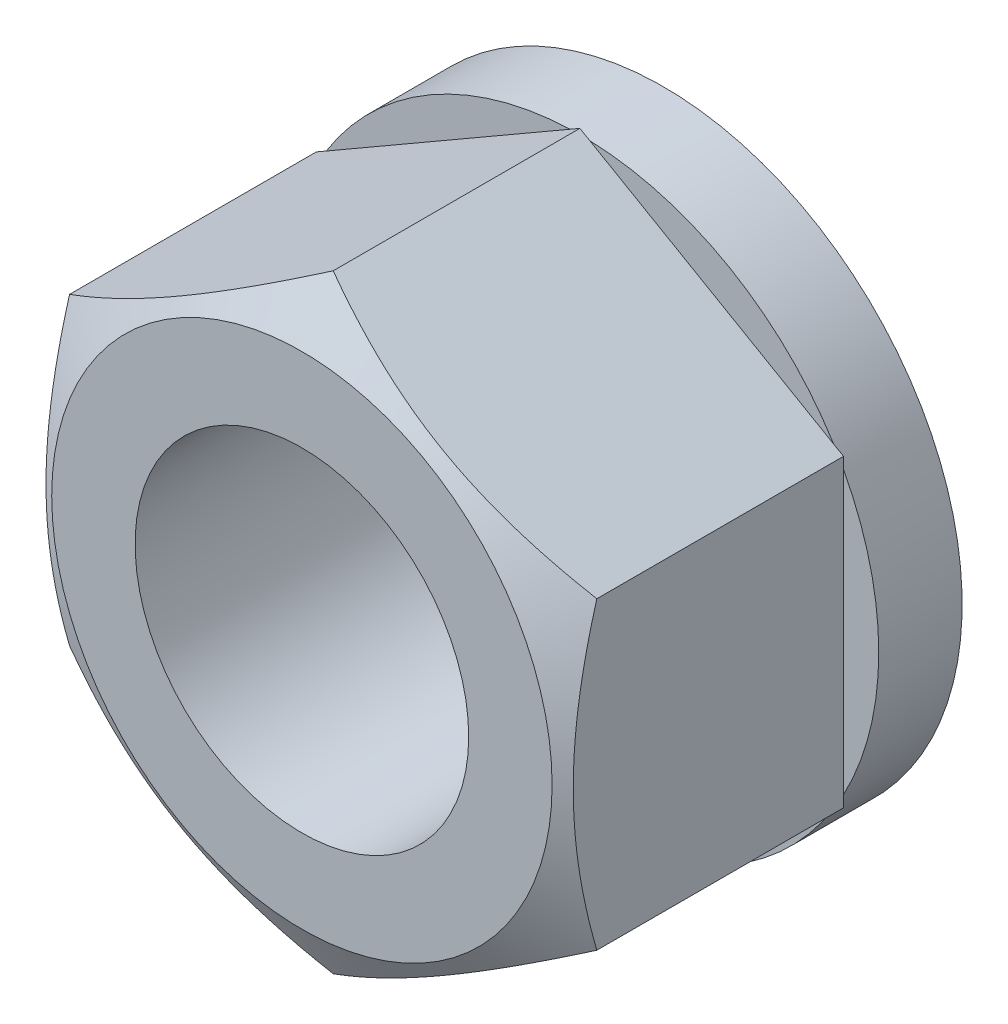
ISO-10303-21;
HEADER;
FILE_DESCRIPTION(('STEP AP214'),'2;1');
FILE_NAME('part.step','',(''),(''),'','','');
FILE_SCHEMA(('AUTOMOTIVE_DESIGN { 1 0 10303 214 1 1 1 1 }'));
ENDSEC;
DATA;
#1=APPLICATION_CONTEXT('core data for automotive mechanical design processes');
#2=APPLICATION_PROTOCOL_DEFINITION('international standard','automotive_design',2000,#1);
#3=PRODUCT_CONTEXT('',#1,'mechanical');
#4=PRODUCT('Part','Part','',(#3));
#5=PRODUCT_RELATED_PRODUCT_CATEGORY('part','',(#4));
#6=PRODUCT_DEFINITION_FORMATION('','',#4);
#7=PRODUCT_DEFINITION_CONTEXT('part definition',#1,'design');
#8=PRODUCT_DEFINITION('design','',#6,#7);
#9=PRODUCT_DEFINITION_SHAPE('','',#8);
#10=(LENGTH_UNIT() NAMED_UNIT(*) SI_UNIT(.MILLI.,.METRE.));
#11=(NAMED_UNIT(*) PLANE_ANGLE_UNIT() SI_UNIT($,.RADIAN.));
#12=(NAMED_UNIT(*) SI_UNIT($,.STERADIAN.) SOLID_ANGLE_UNIT());
#13=UNCERTAINTY_MEASURE_WITH_UNIT(LENGTH_MEASURE(1.E-05),#10,'distance_accuracy_value','');
#14=(GEOMETRIC_REPRESENTATION_CONTEXT(3) GLOBAL_UNCERTAINTY_ASSIGNED_CONTEXT((#13)) GLOBAL_UNIT_ASSIGNED_CONTEXT((#10,
#11,#12)) REPRESENTATION_CONTEXT('',''));
#15=CARTESIAN_POINT('',(0.,0.,0.));
#16=DIRECTION('',(0.,0.,1.));
#17=DIRECTION('',(1.,0.,0.));
#18=AXIS2_PLACEMENT_3D('',#15,#16,#17);
#19=CARTESIAN_POINT('',(0.,0.,3.));
#20=DIRECTION('',(0.,0.,1.));
#21=DIRECTION('',(1.,0.,0.));
#22=AXIS2_PLACEMENT_3D('',#19,#20,#21);
#23=PLANE('',#22);
#24=DIRECTION('',(-0.866025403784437,0.5,0.));
#25=VECTOR('',#24,1.);
#26=CARTESIAN_POINT('',(9.48297817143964,5.47499999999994,3.));
#27=LINE('',#26,#25);
#28=CARTESIAN_POINT('',(9.12631733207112,5.68091823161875,3.));
#29=VERTEX_POINT('',#28);
#30=CARTESIAN_POINT('',(0.356660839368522,10.7440817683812,3.));
#31=VERTEX_POINT('',#30);
#32=EDGE_CURVE('E28',#29,#31,#27,.T.);
#33=ORIENTED_EDGE('',*,*,#32,.F.);
#34=CARTESIAN_POINT('',(0.,0.,3.));
#35=DIRECTION('',(0.,0.,1.));
#36=DIRECTION('',(1.,0.,0.));
#37=AXIS2_PLACEMENT_3D('',#34,#35,#36);
#38=CIRCLE('',#37,10.75);
#39=EDGE_CURVE('E139',#29,#31,#38,.T.);
#40=ORIENTED_EDGE('',*,*,#39,.T.);
#41=EDGE_LOOP('',(#33,#40));
#42=FACE_BOUND('',#41,.T.);
#43=ADVANCED_FACE('F14',(#42),#23,.T.);
#44=DIRECTION('',(0.,1.,0.));
#45=VECTOR('',#44,1.);
#46=CARTESIAN_POINT('',(9.48297817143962,-5.475,3.));
#47=LINE('',#46,#45);
#48=CARTESIAN_POINT('',(9.48297817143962,-5.06316353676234,3.));
#49=VERTEX_POINT('',#48);
#50=CARTESIAN_POINT('',(9.48297817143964,5.0631635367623,3.));
#51=VERTEX_POINT('',#50);
#52=EDGE_CURVE('E41',#49,#51,#47,.T.);
#53=ORIENTED_EDGE('',*,*,#52,.F.);
#54=EDGE_CURVE('E131',#49,#51,#38,.T.);
#55=ORIENTED_EDGE('',*,*,#54,.T.);
#56=EDGE_LOOP('',(#53,#55));
#57=FACE_BOUND('',#56,.T.);
#58=ADVANCED_FACE('F247',(#57),#23,.T.);
#59=DIRECTION('',(0.866025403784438,0.5,0.));
#60=VECTOR('',#59,1.);
#61=CARTESIAN_POINT('',(0.,-10.95,3.));
#62=LINE('',#61,#60);
#63=CARTESIAN_POINT('',(0.356660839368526,-10.7440817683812,3.));
#64=VERTEX_POINT('',#63);
#65=CARTESIAN_POINT('',(9.12631733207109,-5.6809182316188,3.));
#66=VERTEX_POINT('',#65);
#67=EDGE_CURVE('E213',#64,#66,#62,.T.);
#68=ORIENTED_EDGE('',*,*,#67,.F.);
#69=EDGE_CURVE('E154',#64,#66,#38,.T.);
#70=ORIENTED_EDGE('',*,*,#69,.T.);
#71=EDGE_LOOP('',(#68,#70));
#72=FACE_BOUND('',#71,.T.);
#73=ADVANCED_FACE('F254',(#72),#23,.T.);
#74=DIRECTION('',(0.866025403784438,-0.5,0.));
#75=VECTOR('',#74,1.);
#76=CARTESIAN_POINT('',(-9.48297817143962,-5.475,3.));
#77=LINE('',#76,#75);
#78=CARTESIAN_POINT('',(-9.12631733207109,-5.6809182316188,3.));
#79=VERTEX_POINT('',#78);
#80=CARTESIAN_POINT('',(-0.356660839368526,-10.7440817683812,3.));
#81=VERTEX_POINT('',#80);
#82=EDGE_CURVE('E209',#79,#81,#77,.T.);
#83=ORIENTED_EDGE('',*,*,#82,.F.);
#84=EDGE_CURVE('E164',#79,#81,#38,.T.);
#85=ORIENTED_EDGE('',*,*,#84,.T.);
#86=EDGE_LOOP('',(#83,#85));
#87=FACE_BOUND('',#86,.T.);
#88=ADVANCED_FACE('F264',(#87),#23,.T.);
#89=DIRECTION('',(0.,-1.,0.));
#90=VECTOR('',#89,1.);
#91=CARTESIAN_POINT('',(-9.48297817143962,5.475,3.));
#92=LINE('',#91,#90);
#93=CARTESIAN_POINT('',(-9.48297817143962,5.06316353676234,3.));
#94=VERTEX_POINT('',#93);
#95=CARTESIAN_POINT('',(-9.48297817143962,-5.06316353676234,3.));
#96=VERTEX_POINT('',#95);
#97=EDGE_CURVE('E146',#94,#96,#92,.T.);
#98=ORIENTED_EDGE('',*,*,#97,.F.);
#99=EDGE_CURVE('E174',#94,#96,#38,.T.);
#100=ORIENTED_EDGE('',*,*,#99,.T.);
#101=EDGE_LOOP('',(#98,#100));
#102=FACE_BOUND('',#101,.T.);
#103=ADVANCED_FACE('F257',(#102),#23,.T.);
#104=DIRECTION('',(-0.866025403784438,-0.5,0.));
#105=VECTOR('',#104,1.);
#106=CARTESIAN_POINT('',(0.,10.95,3.));
#107=LINE('',#106,#105);
#108=CARTESIAN_POINT('',(-0.356660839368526,10.7440817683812,3.));
#109=VERTEX_POINT('',#108);
#110=CARTESIAN_POINT('',(-9.12631733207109,5.6809182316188,3.));
#111=VERTEX_POINT('',#110);
#112=EDGE_CURVE('E138',#109,#111,#107,.T.);
#113=ORIENTED_EDGE('',*,*,#112,.F.);
#114=EDGE_CURVE('E184',#109,#111,#38,.T.);
#115=ORIENTED_EDGE('',*,*,#114,.T.);
#116=EDGE_LOOP('',(#113,#115));
#117=FACE_BOUND('',#116,.T.);
#118=ADVANCED_FACE('F249',(#117),#23,.T.);
#119=CARTESIAN_POINT('',(0.,0.,3.));
#120=DIRECTION('',(0.,0.,-1.));
#121=DIRECTION('',(-1.,0.,0.));
#122=AXIS2_PLACEMENT_3D('',#119,#120,#121);
#123=CYLINDRICAL_SURFACE('',#122,10.75);
#124=EDGE_CURVE('E136',#51,#29,#38,.T.);
#125=ORIENTED_EDGE('',*,*,#124,.F.);
#126=ORIENTED_EDGE('',*,*,#54,.F.);
#127=EDGE_CURVE('E152',#66,#49,#38,.T.);
#128=ORIENTED_EDGE('',*,*,#127,.F.);
#129=ORIENTED_EDGE('',*,*,#69,.F.);
#130=EDGE_CURVE('E160',#81,#64,#38,.T.);
#131=ORIENTED_EDGE('',*,*,#130,.F.);
#132=ORIENTED_EDGE('',*,*,#84,.F.);
#133=EDGE_CURVE('E170',#96,#79,#38,.T.);
#134=ORIENTED_EDGE('',*,*,#133,.F.);
#135=ORIENTED_EDGE('',*,*,#99,.F.);
#136=EDGE_CURVE('E180',#111,#94,#38,.T.);
#137=ORIENTED_EDGE('',*,*,#136,.F.);
#138=ORIENTED_EDGE('',*,*,#114,.F.);
#139=EDGE_CURVE('E151',#31,#109,#38,.T.);
#140=ORIENTED_EDGE('',*,*,#139,.F.);
#141=ORIENTED_EDGE('',*,*,#39,.F.);
#142=EDGE_LOOP('',(#125,#126,#128,#129,#131,#132,#134,#135,#137,#138,#140,#141));
#143=FACE_BOUND('',#142,.T.);
#144=CARTESIAN_POINT('',(0.,0.,0.));
#145=DIRECTION('',(0.,0.,-1.));
#146=DIRECTION('',(-1.,0.,0.));
#147=AXIS2_PLACEMENT_3D('',#144,#145,#146);
#148=CIRCLE('',#147,10.75);
#149=CARTESIAN_POINT('',(-10.75,0.,0.));
#150=VERTEX_POINT('',#149);
#151=EDGE_CURVE('E345',#150,#150,#148,.T.);
#152=ORIENTED_EDGE('',*,*,#151,.F.);
#153=EDGE_LOOP('',(#152));
#154=FACE_BOUND('',#153,.T.);
#155=ADVANCED_FACE('F16',(#143,#154),#123,.T.);
#156=CARTESIAN_POINT('',(0.,0.,3.));
#157=DIRECTION('',(0.,0.,-1.));
#158=DIRECTION('',(-1.,0.,0.));
#159=AXIS2_PLACEMENT_3D('',#156,#157,#158);
#160=CYLINDRICAL_SURFACE('',#159,6.1);
#161=CARTESIAN_POINT('',(0.,0.,3.));
#162=DIRECTION('',(0.,0.,1.));
#163=DIRECTION('',(1.,0.,0.));
#164=AXIS2_PLACEMENT_3D('',#161,#162,#163);
#165=CIRCLE('',#164,6.1);
#166=CARTESIAN_POINT('',(6.1,0.,3.));
#167=VERTEX_POINT('',#166);
#168=EDGE_CURVE('E128',#167,#167,#165,.T.);
#169=ORIENTED_EDGE('',*,*,#168,.T.);
#170=EDGE_LOOP('',(#169));
#171=FACE_BOUND('',#170,.T.);
#172=CARTESIAN_POINT('',(0.,0.,0.));
#173=DIRECTION('',(0.,0.,-1.));
#174=DIRECTION('',(-1.,0.,0.));
#175=AXIS2_PLACEMENT_3D('',#172,#173,#174);
#176=CIRCLE('',#175,6.1);
#177=CARTESIAN_POINT('',(-6.1,0.,0.));
#178=VERTEX_POINT('',#177);
#179=EDGE_CURVE('E343',#178,#178,#176,.T.);
#180=ORIENTED_EDGE('',*,*,#179,.T.);
#181=EDGE_LOOP('',(#180));
#182=FACE_BOUND('',#181,.T.);
#183=ADVANCED_FACE('F263',(#171,#182),#160,.F.);
#184=CARTESIAN_POINT('',(0.,10.95,13.));
#185=DIRECTION('',(0.,0.,1.));
#186=DIRECTION('',(1.,0.,0.));
#187=AXIS2_PLACEMENT_3D('',#184,#185,#186);
#188=PLANE('',#187);
#189=CARTESIAN_POINT('',(0.,0.,13.));
#190=DIRECTION('',(0.,0.,-1.));
#191=DIRECTION('',(-1.,0.,0.));
#192=AXIS2_PLACEMENT_3D('',#189,#190,#191);
#193=CIRCLE('',#192,9.);
#194=CARTESIAN_POINT('',(-9.,0.,13.));
#195=VERTEX_POINT('',#194);
#196=EDGE_CURVE('E121',#195,#195,#193,.T.);
#197=ORIENTED_EDGE('',*,*,#196,.F.);
#198=EDGE_LOOP('',(#197));
#199=FACE_BOUND('',#198,.T.);
#200=CARTESIAN_POINT('',(0.,0.,13.));
#201=DIRECTION('',(0.,0.,1.));
#202=DIRECTION('',(1.,0.,0.));
#203=AXIS2_PLACEMENT_3D('',#200,#201,#202);
#204=CIRCLE('',#203,6.);
#205=CARTESIAN_POINT('',(6.,0.,13.));
#206=VERTEX_POINT('',#205);
#207=EDGE_CURVE('E347',#206,#206,#204,.T.);
#208=ORIENTED_EDGE('',*,*,#207,.F.);
#209=EDGE_LOOP('',(#208));
#210=FACE_BOUND('',#209,.T.);
#211=ADVANCED_FACE('F332',(#199,#210),#188,.T.);
#212=CARTESIAN_POINT('',(9.48297817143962,-5.475,13.));
#213=DIRECTION('',(-1.,0.,0.));
#214=DIRECTION('',(0.,-1.,0.));
#215=AXIS2_PLACEMENT_3D('',#212,#213,#214);
#216=PLANE('',#215);
#217=DIRECTION('',(0.,0.,-1.));
#218=VECTOR('',#217,1.);
#219=CARTESIAN_POINT('',(9.48297817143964,5.47499999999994,13.));
#220=LINE('',#219,#218);
#221=CARTESIAN_POINT('',(9.48297817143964,5.47499999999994,11.8741669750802));
#222=VERTEX_POINT('',#221);
#223=CARTESIAN_POINT('',(9.48297817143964,5.47499999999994,3.));
#224=VERTEX_POINT('',#223);
#225=EDGE_CURVE('E216',#222,#224,#220,.T.);
#226=ORIENTED_EDGE('',*,*,#225,.F.);
#227=CARTESIAN_POINT('',(9.4829781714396,-14.5596755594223,8.1643525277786));
#228=CARTESIAN_POINT('',(9.4829781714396,-14.3531914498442,8.26424422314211));
#229=CARTESIAN_POINT('',(9.4829781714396,-14.1464610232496,8.36362652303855));
#230=CARTESIAN_POINT('',(9.4829781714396,-13.7324560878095,8.5612566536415));
#231=CARTESIAN_POINT('',(9.4829781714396,-13.5251815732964,8.6595044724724));
#232=CARTESIAN_POINT('',(9.4829781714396,-12.9024074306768,8.95239956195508));
#233=CARTESIAN_POINT('',(9.4829781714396,-12.4860206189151,9.1451677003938));
#234=CARTESIAN_POINT('',(9.4829781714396,-11.6480734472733,9.52556842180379));
#235=CARTESIAN_POINT('',(9.48297817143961,-11.2264971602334,9.71316600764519));
#236=CARTESIAN_POINT('',(9.48297817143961,-10.3799402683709,10.0804879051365));
#237=CARTESIAN_POINT('',(9.48297817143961,-9.95495983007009,10.2602125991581));
#238=CARTESIAN_POINT('',(9.48297817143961,-9.08779519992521,10.6150700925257));
#239=CARTESIAN_POINT('',(9.48297817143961,-8.645483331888,10.7898926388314));
#240=CARTESIAN_POINT('',(9.48297817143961,-7.75563205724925,11.1259475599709));
#241=CARTESIAN_POINT('',(9.48297817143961,-7.30809206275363,11.2871783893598));
#242=CARTESIAN_POINT('',(9.48297817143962,-6.40795328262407,11.5917084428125));
#243=CARTESIAN_POINT('',(9.48297817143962,-5.95536736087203,11.7350452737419));
#244=CARTESIAN_POINT('',(9.48297817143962,-5.04372276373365,11.9990937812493));
#245=CARTESIAN_POINT('',(9.48297817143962,-4.58466622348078,12.1198127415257));
#246=CARTESIAN_POINT('',(9.48297817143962,-3.66225298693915,12.3320961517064));
#247=CARTESIAN_POINT('',(9.48297817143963,-3.19893224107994,12.4238125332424));
#248=CARTESIAN_POINT('',(9.48297817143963,-2.49985211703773,12.5355904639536));
#249=CARTESIAN_POINT('',(9.48297817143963,-2.26612393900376,12.5685518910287));
#250=CARTESIAN_POINT('',(9.48297817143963,-1.79755647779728,12.625226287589));
#251=CARTESIAN_POINT('',(9.48297817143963,-1.56271730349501,12.648940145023));
#252=CARTESIAN_POINT('',(9.48297817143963,-1.09524528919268,12.686357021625));
#253=CARTESIAN_POINT('',(9.48297817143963,-0.862622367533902,12.7001835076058));
#254=CARTESIAN_POINT('',(9.48297817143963,-0.397000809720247,12.7179979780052));
#255=CARTESIAN_POINT('',(9.48297817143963,-0.164002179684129,12.7219861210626));
#256=CARTESIAN_POINT('',(9.48297817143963,0.301956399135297,12.7200290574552));
#257=CARTESIAN_POINT('',(9.48297817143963,0.534916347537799,12.7140837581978));
#258=CARTESIAN_POINT('',(9.48297817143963,1.00038339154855,12.6924022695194));
#259=CARTESIAN_POINT('',(9.48297817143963,1.23289046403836,12.6766655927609));
#260=CARTESIAN_POINT('',(9.48297817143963,1.79619581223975,12.6270064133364));
#261=CARTESIAN_POINT('',(9.48297817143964,2.12656969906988,12.588187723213));
#262=CARTESIAN_POINT('',(9.48297817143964,2.78476965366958,12.4929315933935));
#263=CARTESIAN_POINT('',(9.48297817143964,3.11259534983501,12.4364916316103));
#264=CARTESIAN_POINT('',(9.48297817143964,3.76541934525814,12.3080010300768));
#265=CARTESIAN_POINT('',(9.48297817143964,4.09041514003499,12.235937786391));
#266=CARTESIAN_POINT('',(9.48297817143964,4.73710047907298,12.0783907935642));
#267=CARTESIAN_POINT('',(9.48297817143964,5.05879008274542,11.9929072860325));
#268=CARTESIAN_POINT('',(9.48297817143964,5.7058598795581,11.808592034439));
#269=CARTESIAN_POINT('',(9.48297817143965,6.03116849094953,11.7095107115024));
#270=CARTESIAN_POINT('',(9.48297817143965,6.67857986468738,11.5014284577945));
#271=CARTESIAN_POINT('',(9.48297817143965,7.00068260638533,11.3924274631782));
#272=CARTESIAN_POINT('',(9.48297817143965,7.64184704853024,11.1662086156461));
#273=CARTESIAN_POINT('',(9.48297817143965,7.96090979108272,11.048993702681));
#274=CARTESIAN_POINT('',(9.48297817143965,8.59641278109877,10.8076947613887));
#275=CARTESIAN_POINT('',(9.48297817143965,8.9128530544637,10.6836108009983));
#276=CARTESIAN_POINT('',(9.48297817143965,9.63911108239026,10.3911863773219));
#277=CARTESIAN_POINT('',(9.48297817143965,10.0481212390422,10.220843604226));
#278=CARTESIAN_POINT('',(9.48297817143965,10.8628429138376,9.87242321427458));
#279=CARTESIAN_POINT('',(9.48297817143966,11.2685542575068,9.69434519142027));
#280=CARTESIAN_POINT('',(9.48297817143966,12.0772674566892,9.33194983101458));
#281=CARTESIAN_POINT('',(9.48297817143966,12.4802687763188,9.14763130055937));
#282=CARTESIAN_POINT('',(9.48297817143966,13.2839200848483,8.77396765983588));
#283=CARTESIAN_POINT('',(9.48297817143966,13.6845701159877,8.58462264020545));
#284=CARTESIAN_POINT('',(9.48297817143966,14.4842867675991,8.20162873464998));
#285=CARTESIAN_POINT('',(9.48297817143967,14.8833514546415,8.00797581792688));
#286=CARTESIAN_POINT('',(9.48297817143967,15.6798068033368,7.61725458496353));
#287=CARTESIAN_POINT('',(9.48297817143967,16.0771974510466,7.42018624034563));
#288=CARTESIAN_POINT('',(9.48297817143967,17.2671534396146,6.82478343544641));
#289=CARTESIAN_POINT('',(9.48297817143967,18.0575958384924,6.42220631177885));
#290=CARTESIAN_POINT('',(9.48297817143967,19.5716727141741,5.64131960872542));
#291=CARTESIAN_POINT('',(9.48297817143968,20.2956249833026,5.26362355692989));
#292=CARTESIAN_POINT('',(9.48297817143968,21.7408334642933,4.50305867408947));
#293=CARTESIAN_POINT('',(9.48297817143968,22.4620895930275,4.1201896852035));
#294=CARTESIAN_POINT('',(9.48297817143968,23.9008559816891,3.35136008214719));
#295=CARTESIAN_POINT('',(9.48297817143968,24.6183710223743,2.96540840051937));
#296=CARTESIAN_POINT('',(9.48297817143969,26.0516650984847,2.19037903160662));
#297=CARTESIAN_POINT('',(9.48297817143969,26.7674442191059,1.8013015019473));
#298=CARTESIAN_POINT('',(9.48297817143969,27.4825783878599,1.41105000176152));
#299=B_SPLINE_CURVE_WITH_KNOTS('',3,(#227,#228,#229,#230,#231,#232,#233,#234,#235,#236,#237,
#238,#239,#240,#241,#242,#243,#244,#245,#246,#247,#248,#249,#250,#251,#252,#253,#254,#255,#256,
#257,#258,#259,#260,#261,#262,#263,#264,#265,#266,#267,#268,#269,#270,#271,#272,#273,#274,#275,
#276,#277,#278,#279,#280,#281,#282,#283,#284,#285,#286,#287,#288,#289,#290,#291,#292,#293,#294,
#295,#296,#297,#298),.UNSPECIFIED.,.F.,.F.,(4,2,2,2,2,2,2,2,2,2,2,2,2,2,2,2,2,2,2,2,2,2,2,2,2,2,
2,2,2,2,2,2,2,2,2,4),(0.,0.688131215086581,1.37626962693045,2.7527578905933,4.13699084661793,
5.52115649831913,6.9478065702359,8.37461864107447,9.79837968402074,11.221681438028,
12.6373986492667,13.345367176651,14.0532677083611,14.7521663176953,15.4510536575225,
16.1499475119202,16.8488761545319,17.8462609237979,18.843788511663,19.8421238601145,
20.8404412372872,21.8604402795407,22.8804458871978,23.9000882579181,24.9197205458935,
26.2488074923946,27.5779642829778,28.9073765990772,30.2367649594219,31.567454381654,
32.898154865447,35.5592460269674,38.0088869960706,40.4586028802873,42.9027875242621,
45.3468496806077),.UNSPECIFIED.);
#300=CARTESIAN_POINT('',(9.48297817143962,-5.475,11.8741669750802));
#301=VERTEX_POINT('',#300);
#302=EDGE_CURVE('E35',#222,#301,#299,.F.);
#303=ORIENTED_EDGE('',*,*,#302,.T.);
#304=DIRECTION('',(0.,0.,-1.));
#305=VECTOR('',#304,1.);
#306=CARTESIAN_POINT('',(9.48297817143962,-5.475,13.));
#307=LINE('',#306,#305);
#308=CARTESIAN_POINT('',(9.48297817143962,-5.475,3.));
#309=VERTEX_POINT('',#308);
#310=EDGE_CURVE('E218',#301,#309,#307,.T.);
#311=ORIENTED_EDGE('',*,*,#310,.T.);
#312=EDGE_CURVE('E214',#309,#49,#47,.T.);
#313=ORIENTED_EDGE('',*,*,#312,.T.);
#314=ORIENTED_EDGE('',*,*,#52,.T.);
#315=EDGE_CURVE('E212',#51,#224,#47,.T.);
#316=ORIENTED_EDGE('',*,*,#315,.T.);
#317=EDGE_LOOP('',(#226,#303,#311,#313,#314,#316));
#318=FACE_BOUND('',#317,.T.);
#319=ADVANCED_FACE('F313',(#318),#216,.F.);
#320=CARTESIAN_POINT('',(0.,-10.95,13.));
#321=DIRECTION('',(-0.5,0.866025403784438,0.));
#322=DIRECTION('',(-0.866025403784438,-0.5,0.));
#323=AXIS2_PLACEMENT_3D('',#320,#321,#322);
#324=PLANE('',#323);
#325=ORIENTED_EDGE('',*,*,#310,.F.);
#326=CARTESIAN_POINT('',(9.48317817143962,-5.47488452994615,11.8741003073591));
#327=CARTESIAN_POINT('',(9.27472157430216,-5.59523700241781,11.9435746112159));
#328=CARTESIAN_POINT('',(9.06548774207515,-5.71603821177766,12.0098957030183));
#329=CARTESIAN_POINT('',(8.64534217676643,-5.95860936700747,12.1353565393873));
#330=CARTESIAN_POINT('',(8.43442991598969,-6.08037961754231,12.1944939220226));
#331=CARTESIAN_POINT('',(7.79829469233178,-6.44765246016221,12.3599860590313));
#332=CARTESIAN_POINT('',(7.37056049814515,-6.69460491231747,12.4541172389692));
#333=CARTESIAN_POINT('',(6.73047585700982,-7.0641579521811,12.5644948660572));
#334=CARTESIAN_POINT('',(6.5200377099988,-7.18565447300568,12.5959373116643));
#335=CARTESIAN_POINT('',(6.09818709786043,-7.42921003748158,12.6486643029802));
#336=CARTESIAN_POINT('',(5.88677461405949,-7.55126909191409,12.6699486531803));
#337=CARTESIAN_POINT('',(5.46359699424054,-7.79559080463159,12.7018140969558));
#338=CARTESIAN_POINT('',(5.25183257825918,-7.91785304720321,12.7124079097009));
#339=CARTESIAN_POINT('',(4.82810813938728,-8.16249046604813,12.7226671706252));
#340=CARTESIAN_POINT('',(4.61614812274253,-8.28486563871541,12.7223329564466));
#341=CARTESIAN_POINT('',(4.21988362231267,-8.51364905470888,12.7114963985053));
#342=CARTESIAN_POINT('',(4.03555117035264,-8.62007344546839,12.7023159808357));
#343=CARTESIAN_POINT('',(3.66731738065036,-8.83267332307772,12.6758683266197));
#344=CARTESIAN_POINT('',(3.48341607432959,-8.93884879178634,12.6586005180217));
#345=CARTESIAN_POINT('',(2.93242473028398,-9.25696379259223,12.5950742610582));
#346=CARTESIAN_POINT('',(2.56630998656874,-9.46834023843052,12.5371008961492));
#347=CARTESIAN_POINT('',(1.83019690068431,-9.8933353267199,12.3921669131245));
#348=CARTESIAN_POINT('',(1.46029250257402,-10.1068997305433,12.3045919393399));
#349=CARTESIAN_POINT('',(0.725999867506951,-10.5308437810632,12.1058331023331));
#350=CARTESIAN_POINT('',(0.361602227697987,-10.741228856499,11.9946959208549));
#351=CARTESIAN_POINT('',(-0.000199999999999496,-10.9501154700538,11.8741003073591));
#352=B_SPLINE_CURVE_WITH_KNOTS('',3,(#326,#327,#328,#329,#330,#331,#332,#333,#334,#335,#336,
#337,#338,#339,#340,#341,#342,#343,#344,#345,#346,#347,#348,#349,#350,#351),.UNSPECIFIED.,.F.,
.F.,(4,2,2,2,2,2,2,2,2,2,2,2,4),(0.,0.751531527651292,1.50330948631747,3.01006572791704,
3.74495129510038,4.47985100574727,5.21387532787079,5.94787697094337,6.58685772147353,
7.22588367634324,8.50484368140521,9.81216804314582,11.116926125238),.UNSPECIFIED.);
#353=CARTESIAN_POINT('',(0.,-10.95,11.8741669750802));
#354=VERTEX_POINT('',#353);
#355=EDGE_CURVE('E267',#301,#354,#352,.T.);
#356=ORIENTED_EDGE('',*,*,#355,.T.);
#357=DIRECTION('',(0.,0.,-1.));
#358=VECTOR('',#357,1.);
#359=CARTESIAN_POINT('',(0.,-10.95,13.));
#360=LINE('',#359,#358);
#361=CARTESIAN_POINT('',(0.,-10.95,3.));
#362=VERTEX_POINT('',#361);
#363=EDGE_CURVE('E220',#354,#362,#360,.T.);
#364=ORIENTED_EDGE('',*,*,#363,.T.);
#365=EDGE_CURVE('E210',#362,#64,#62,.T.);
#366=ORIENTED_EDGE('',*,*,#365,.T.);
#367=ORIENTED_EDGE('',*,*,#67,.T.);
#368=EDGE_CURVE('E208',#66,#309,#62,.T.);
#369=ORIENTED_EDGE('',*,*,#368,.T.);
#370=EDGE_LOOP('',(#325,#356,#364,#366,#367,#369));
#371=FACE_BOUND('',#370,.T.);
#372=ADVANCED_FACE('F310',(#371),#324,.F.);
#373=CARTESIAN_POINT('',(-9.48297817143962,-5.475,13.));
#374=DIRECTION('',(0.5,0.866025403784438,0.));
#375=DIRECTION('',(-0.866025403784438,0.5,0.));
#376=AXIS2_PLACEMENT_3D('',#373,#374,#375);
#377=PLANE('',#376);
#378=ORIENTED_EDGE('',*,*,#363,.F.);
#379=CARTESIAN_POINT('',(0.0002,-10.9501154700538,11.8741003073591));
#380=CARTESIAN_POINT('',(-0.208256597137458,-10.8297629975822,11.9435746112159));
#381=CARTESIAN_POINT('',(-0.417490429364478,-10.7089617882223,12.0098957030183));
#382=CARTESIAN_POINT('',(-0.837635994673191,-10.4663906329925,12.1353565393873));
#383=CARTESIAN_POINT('',(-1.04854825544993,-10.3446203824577,12.1944939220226));
#384=CARTESIAN_POINT('',(-1.68468347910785,-9.97734753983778,12.3599860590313));
#385=CARTESIAN_POINT('',(-2.11241767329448,-9.73039508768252,12.4541172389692));
#386=CARTESIAN_POINT('',(-2.75250231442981,-9.36084204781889,12.5644948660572));
#387=CARTESIAN_POINT('',(-2.96294046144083,-9.23934552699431,12.5959373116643));
#388=CARTESIAN_POINT('',(-3.3847910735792,-8.99578996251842,12.6486643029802));
#389=CARTESIAN_POINT('',(-3.59620355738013,-8.8737309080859,12.6699486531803));
#390=CARTESIAN_POINT('',(-4.01938117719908,-8.6294091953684,12.7018140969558));
#391=CARTESIAN_POINT('',(-4.23114559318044,-8.50714695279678,12.7124079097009));
#392=CARTESIAN_POINT('',(-4.65487003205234,-8.26250953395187,12.7226671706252));
#393=CARTESIAN_POINT('',(-4.86683004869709,-8.14013436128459,12.7223329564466));
#394=CARTESIAN_POINT('',(-5.26309454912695,-7.91135094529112,12.7114963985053));
#395=CARTESIAN_POINT('',(-5.44742700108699,-7.8049265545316,12.7023159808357));
#396=CARTESIAN_POINT('',(-5.81566079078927,-7.59232667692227,12.6758683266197));
#397=CARTESIAN_POINT('',(-5.99956209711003,-7.48615120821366,12.6586005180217));
#398=CARTESIAN_POINT('',(-6.55055344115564,-7.16803620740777,12.5950742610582));
#399=CARTESIAN_POINT('',(-6.91666818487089,-6.95665976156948,12.5371008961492));
#400=CARTESIAN_POINT('',(-7.65278127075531,-6.5316646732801,12.3921669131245));
#401=CARTESIAN_POINT('',(-8.0226856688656,-6.3181002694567,12.3045919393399));
#402=CARTESIAN_POINT('',(-8.75697830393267,-5.89415621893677,12.1058331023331));
#403=CARTESIAN_POINT('',(-9.12137594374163,-5.683771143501,11.9946959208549));
#404=CARTESIAN_POINT('',(-9.48317817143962,-5.47488452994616,11.8741003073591));
#405=B_SPLINE_CURVE_WITH_KNOTS('',3,(#379,#380,#381,#382,#383,#384,#385,#386,#387,#388,#389,
#390,#391,#392,#393,#394,#395,#396,#397,#398,#399,#400,#401,#402,#403,#404),.UNSPECIFIED.,.F.,
.F.,(4,2,2,2,2,2,2,2,2,2,2,2,4),(0.,0.751531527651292,1.50330948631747,3.01006572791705,
3.74495129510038,4.47985100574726,5.21387532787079,5.94787697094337,6.58685772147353,
7.22588367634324,8.50484368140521,9.81216804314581,11.116926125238),.UNSPECIFIED.);
#406=CARTESIAN_POINT('',(-9.48297817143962,-5.475,11.8741669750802));
#407=VERTEX_POINT('',#406);
#408=EDGE_CURVE('E227',#354,#407,#405,.T.);
#409=ORIENTED_EDGE('',*,*,#408,.T.);
#410=DIRECTION('',(0.,0.,-1.));
#411=VECTOR('',#410,1.);
#412=CARTESIAN_POINT('',(-9.48297817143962,-5.475,13.));
#413=LINE('',#412,#411);
#414=CARTESIAN_POINT('',(-9.48297817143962,-5.475,3.));
#415=VERTEX_POINT('',#414);
#416=EDGE_CURVE('E133',#407,#415,#413,.T.);
#417=ORIENTED_EDGE('',*,*,#416,.T.);
#418=EDGE_CURVE('E206',#415,#79,#77,.T.);
#419=ORIENTED_EDGE('',*,*,#418,.T.);
#420=ORIENTED_EDGE('',*,*,#82,.T.);
#421=EDGE_CURVE('E205',#81,#362,#77,.T.);
#422=ORIENTED_EDGE('',*,*,#421,.T.);
#423=EDGE_LOOP('',(#378,#409,#417,#419,#420,#422));
#424=FACE_BOUND('',#423,.T.);
#425=ADVANCED_FACE('F225',(#424),#377,.F.);
#426=CARTESIAN_POINT('',(-9.48297817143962,5.475,13.));
#427=DIRECTION('',(1.,0.,0.));
#428=DIRECTION('',(0.,0.,-1.));
#429=AXIS2_PLACEMENT_3D('',#426,#427,#428);
#430=PLANE('',#429);
#431=ORIENTED_EDGE('',*,*,#416,.F.);
#432=CARTESIAN_POINT('',(-9.48297817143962,-14.5596755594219,8.16435252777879));
#433=CARTESIAN_POINT('',(-9.48297817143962,-14.3531914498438,8.26424422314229));
#434=CARTESIAN_POINT('',(-9.48297817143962,-14.1464610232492,8.36362652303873));
#435=CARTESIAN_POINT('',(-9.48297817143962,-13.7324560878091,8.56125665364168));
#436=CARTESIAN_POINT('',(-9.48297817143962,-13.525181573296,8.65950447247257));
#437=CARTESIAN_POINT('',(-9.48297817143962,-12.9024074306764,8.95239956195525));
#438=CARTESIAN_POINT('',(-9.48297817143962,-12.4860206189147,9.14516770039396));
#439=CARTESIAN_POINT('',(-9.48297817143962,-11.6480734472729,9.52556842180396));
#440=CARTESIAN_POINT('',(-9.48297817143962,-11.226497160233,9.71316600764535));
#441=CARTESIAN_POINT('',(-9.48297817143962,-10.3799402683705,10.0804879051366));
#442=CARTESIAN_POINT('',(-9.48297817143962,-9.95495983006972,10.2602125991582));
#443=CARTESIAN_POINT('',(-9.48297817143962,-9.08779519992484,10.6150700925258));
#444=CARTESIAN_POINT('',(-9.48297817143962,-8.64548333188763,10.7898926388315));
#445=CARTESIAN_POINT('',(-9.48297817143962,-7.75563205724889,11.125947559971));
#446=CARTESIAN_POINT('',(-9.48297817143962,-7.30809206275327,11.2871783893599));
#447=CARTESIAN_POINT('',(-9.48297817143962,-6.40795328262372,11.5917084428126));
#448=CARTESIAN_POINT('',(-9.48297817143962,-5.95536736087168,11.735045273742));
#449=CARTESIAN_POINT('',(-9.48297817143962,-5.0437227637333,11.9990937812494));
#450=CARTESIAN_POINT('',(-9.48297817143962,-4.58466622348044,12.1198127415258));
#451=CARTESIAN_POINT('',(-9.48297817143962,-3.66225298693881,12.3320961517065));
#452=CARTESIAN_POINT('',(-9.48297817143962,-3.1989322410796,12.4238125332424));
#453=CARTESIAN_POINT('',(-9.48297817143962,-2.4998521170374,12.5355904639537));
#454=CARTESIAN_POINT('',(-9.48297817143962,-2.26612393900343,12.5685518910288));
#455=CARTESIAN_POINT('',(-9.48297817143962,-1.79755647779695,12.625226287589));
#456=CARTESIAN_POINT('',(-9.48297817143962,-1.56271730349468,12.6489401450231));
#457=CARTESIAN_POINT('',(-9.48297817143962,-1.09524528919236,12.6863570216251));
#458=CARTESIAN_POINT('',(-9.48297817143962,-0.862622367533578,12.7001835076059));
#459=CARTESIAN_POINT('',(-9.48297817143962,-0.397000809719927,12.7179979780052));
#460=CARTESIAN_POINT('',(-9.48297817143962,-0.16400217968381,12.7219861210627));
#461=CARTESIAN_POINT('',(-9.48297817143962,0.301956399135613,12.7200290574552));
#462=CARTESIAN_POINT('',(-9.48297817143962,0.534916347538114,12.7140837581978));
#463=CARTESIAN_POINT('',(-9.48297817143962,1.00038339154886,12.6924022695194));
#464=CARTESIAN_POINT('',(-9.48297817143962,1.23289046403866,12.6766655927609));
#465=CARTESIAN_POINT('',(-9.48297817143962,1.79619581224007,12.6270064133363));
#466=CARTESIAN_POINT('',(-9.48297817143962,2.12656969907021,12.588187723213));
#467=CARTESIAN_POINT('',(-9.48297817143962,2.78476965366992,12.4929315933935));
#468=CARTESIAN_POINT('',(-9.48297817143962,3.11259534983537,12.4364916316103));
#469=CARTESIAN_POINT('',(-9.48297817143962,3.76541934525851,12.3080010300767));
#470=CARTESIAN_POINT('',(-9.48297817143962,4.09041514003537,12.2359377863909));
#471=CARTESIAN_POINT('',(-9.48297817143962,4.73710047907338,12.0783907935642));
#472=CARTESIAN_POINT('',(-9.48297817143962,5.05879008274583,11.9929072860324));
#473=CARTESIAN_POINT('',(-9.48297817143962,5.70585987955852,11.8085920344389));
#474=CARTESIAN_POINT('',(-9.48297817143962,6.03116849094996,11.7095107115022));
#475=CARTESIAN_POINT('',(-9.48297817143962,6.67857986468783,11.5014284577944));
#476=CARTESIAN_POINT('',(-9.48297817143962,7.00068260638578,11.392427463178));
#477=CARTESIAN_POINT('',(-9.48297817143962,7.64184704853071,11.166208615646));
#478=CARTESIAN_POINT('',(-9.48297817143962,7.9609097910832,11.0489937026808));
#479=CARTESIAN_POINT('',(-9.48297817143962,8.59641278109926,10.8076947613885));
#480=CARTESIAN_POINT('',(-9.48297817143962,8.91285305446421,10.6836108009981));
#481=CARTESIAN_POINT('',(-9.48297817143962,9.63911108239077,10.3911863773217));
#482=CARTESIAN_POINT('',(-9.48297817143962,10.0481212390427,10.2208436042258));
#483=CARTESIAN_POINT('',(-9.48297817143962,10.8628429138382,9.87242321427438));
#484=CARTESIAN_POINT('',(-9.48297817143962,11.2685542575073,9.69434519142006));
#485=CARTESIAN_POINT('',(-9.48297817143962,12.0772674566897,9.33194983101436));
#486=CARTESIAN_POINT('',(-9.48297817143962,12.4802687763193,9.14763130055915));
#487=CARTESIAN_POINT('',(-9.48297817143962,13.2839200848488,8.77396765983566));
#488=CARTESIAN_POINT('',(-9.48297817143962,13.6845701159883,8.58462264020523));
#489=CARTESIAN_POINT('',(-9.48297817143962,14.4842867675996,8.20162873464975));
#490=CARTESIAN_POINT('',(-9.48297817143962,14.883351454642,8.00797581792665));
#491=CARTESIAN_POINT('',(-9.48297817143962,15.6798068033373,7.6172545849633));
#492=CARTESIAN_POINT('',(-9.48297817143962,16.0771974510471,7.42018624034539));
#493=CARTESIAN_POINT('',(-9.48297817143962,17.2671534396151,6.82478343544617));
#494=CARTESIAN_POINT('',(-9.48297817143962,18.057595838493,6.4222063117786));
#495=CARTESIAN_POINT('',(-9.48297817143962,19.5716727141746,5.64131960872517));
#496=CARTESIAN_POINT('',(-9.48297817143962,20.2956249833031,5.26362355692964));
#497=CARTESIAN_POINT('',(-9.48297817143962,21.7408334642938,4.50305867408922));
#498=CARTESIAN_POINT('',(-9.48297817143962,22.462089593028,4.12018968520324));
#499=CARTESIAN_POINT('',(-9.48297817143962,23.9008559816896,3.35136008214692));
#500=CARTESIAN_POINT('',(-9.48297817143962,24.6183710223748,2.9654084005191));
#501=CARTESIAN_POINT('',(-9.48297817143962,26.0516650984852,2.19037903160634));
#502=CARTESIAN_POINT('',(-9.48297817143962,26.7674442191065,1.80130150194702));
#503=CARTESIAN_POINT('',(-9.48297817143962,27.4825783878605,1.41105000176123));
#504=B_SPLINE_CURVE_WITH_KNOTS('',3,(#432,#433,#434,#435,#436,#437,#438,#439,#440,#441,#442,
#443,#444,#445,#446,#447,#448,#449,#450,#451,#452,#453,#454,#455,#456,#457,#458,#459,#460,#461,
#462,#463,#464,#465,#466,#467,#468,#469,#470,#471,#472,#473,#474,#475,#476,#477,#478,#479,#480,
#481,#482,#483,#484,#485,#486,#487,#488,#489,#490,#491,#492,#493,#494,#495,#496,#497,#498,#499,
#500,#501,#502,#503),.UNSPECIFIED.,.F.,.F.,(4,2,2,2,2,2,2,2,2,2,2,2,2,2,2,2,2,2,2,2,2,2,2,2,2,2,
2,2,2,2,2,2,2,2,2,4),(0.,0.688131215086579,1.37626962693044,2.75275789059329,4.13699084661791,
5.5211564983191,6.94780657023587,8.37461864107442,9.79837968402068,11.2216814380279,
12.6373986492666,13.3453671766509,14.053267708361,14.7521663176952,15.4510536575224,
16.1499475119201,16.8488761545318,17.8462609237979,18.8437885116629,19.8421238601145,
20.8404412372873,21.8604402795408,22.8804458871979,23.9000882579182,24.9197205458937,
26.2488074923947,27.577964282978,28.9073765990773,30.236764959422,31.5674543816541,
32.8981548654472,35.5592460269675,38.0088869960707,40.4586028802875,42.9027875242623,
45.3468496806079),.UNSPECIFIED.);
#505=CARTESIAN_POINT('',(-9.48297817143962,5.475,11.8741669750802));
#506=VERTEX_POINT('',#505);
#507=EDGE_CURVE('E120',#407,#506,#504,.T.);
#508=ORIENTED_EDGE('',*,*,#507,.T.);
#509=DIRECTION('',(0.,0.,-1.));
#510=VECTOR('',#509,1.);
#511=CARTESIAN_POINT('',(-9.48297817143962,5.475,13.));
#512=LINE('',#511,#510);
#513=CARTESIAN_POINT('',(-9.48297817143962,5.475,3.));
#514=VERTEX_POINT('',#513);
#515=EDGE_CURVE('E119',#506,#514,#512,.T.);
#516=ORIENTED_EDGE('',*,*,#515,.T.);
#517=EDGE_CURVE('E199',#514,#94,#92,.T.);
#518=ORIENTED_EDGE('',*,*,#517,.T.);
#519=ORIENTED_EDGE('',*,*,#97,.T.);
#520=EDGE_CURVE('E197',#96,#415,#92,.T.);
#521=ORIENTED_EDGE('',*,*,#520,.T.);
#522=EDGE_LOOP('',(#431,#508,#516,#518,#519,#521));
#523=FACE_BOUND('',#522,.T.);
#524=ADVANCED_FACE('F230',(#523),#430,.F.);
#525=CARTESIAN_POINT('',(0.,10.95,13.));
#526=DIRECTION('',(0.5,-0.866025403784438,0.));
#527=DIRECTION('',(0.866025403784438,0.5,0.));
#528=AXIS2_PLACEMENT_3D('',#525,#526,#527);
#529=PLANE('',#528);
#530=ORIENTED_EDGE('',*,*,#515,.F.);
#531=CARTESIAN_POINT('',(-9.48317817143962,5.47488452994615,11.8741003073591));
#532=CARTESIAN_POINT('',(-9.27472157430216,5.59523700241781,11.9435746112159));
#533=CARTESIAN_POINT('',(-9.06548774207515,5.71603821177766,12.0098957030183));
#534=CARTESIAN_POINT('',(-8.64534217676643,5.95860936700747,12.1353565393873));
#535=CARTESIAN_POINT('',(-8.43442991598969,6.08037961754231,12.1944939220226));
#536=CARTESIAN_POINT('',(-7.79829469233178,6.44765246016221,12.3599860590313));
#537=CARTESIAN_POINT('',(-7.37056049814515,6.69460491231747,12.4541172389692));
#538=CARTESIAN_POINT('',(-6.73047585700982,7.0641579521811,12.5644948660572));
#539=CARTESIAN_POINT('',(-6.5200377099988,7.18565447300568,12.5959373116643));
#540=CARTESIAN_POINT('',(-6.09818709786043,7.42921003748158,12.6486643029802));
#541=CARTESIAN_POINT('',(-5.88677461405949,7.55126909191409,12.6699486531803));
#542=CARTESIAN_POINT('',(-5.46359699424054,7.79559080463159,12.7018140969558));
#543=CARTESIAN_POINT('',(-5.25183257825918,7.91785304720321,12.7124079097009));
#544=CARTESIAN_POINT('',(-4.82810813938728,8.16249046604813,12.7226671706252));
#545=CARTESIAN_POINT('',(-4.61614812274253,8.28486563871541,12.7223329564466));
#546=CARTESIAN_POINT('',(-4.21988362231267,8.51364905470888,12.7114963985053));
#547=CARTESIAN_POINT('',(-4.03555117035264,8.62007344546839,12.7023159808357));
#548=CARTESIAN_POINT('',(-3.66731738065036,8.83267332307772,12.6758683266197));
#549=CARTESIAN_POINT('',(-3.48341607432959,8.93884879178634,12.6586005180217));
#550=CARTESIAN_POINT('',(-2.93242473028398,9.25696379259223,12.5950742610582));
#551=CARTESIAN_POINT('',(-2.56630998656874,9.46834023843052,12.5371008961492));
#552=CARTESIAN_POINT('',(-1.83019690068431,9.8933353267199,12.3921669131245));
#553=CARTESIAN_POINT('',(-1.46029250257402,10.1068997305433,12.3045919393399));
#554=CARTESIAN_POINT('',(-0.725999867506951,10.5308437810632,12.1058331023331));
#555=CARTESIAN_POINT('',(-0.361602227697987,10.741228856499,11.9946959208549));
#556=CARTESIAN_POINT('',(0.000199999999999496,10.9501154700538,11.8741003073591));
#557=B_SPLINE_CURVE_WITH_KNOTS('',3,(#531,#532,#533,#534,#535,#536,#537,#538,#539,#540,#541,
#542,#543,#544,#545,#546,#547,#548,#549,#550,#551,#552,#553,#554,#555,#556),.UNSPECIFIED.,.F.,
.F.,(4,2,2,2,2,2,2,2,2,2,2,2,4),(0.,0.751531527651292,1.50330948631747,3.01006572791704,
3.74495129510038,4.47985100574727,5.21387532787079,5.94787697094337,6.58685772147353,
7.22588367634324,8.50484368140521,9.81216804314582,11.116926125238),.UNSPECIFIED.);
#558=CARTESIAN_POINT('',(0.,10.95,11.8741669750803));
#559=VERTEX_POINT('',#558);
#560=EDGE_CURVE('E107',#506,#559,#557,.T.);
#561=ORIENTED_EDGE('',*,*,#560,.T.);
#562=DIRECTION('',(0.,0.,-1.));
#563=VECTOR('',#562,1.);
#564=CARTESIAN_POINT('',(0.,10.95,13.));
#565=LINE('',#564,#563);
#566=CARTESIAN_POINT('',(0.,10.95,3.));
#567=VERTEX_POINT('',#566);
#568=EDGE_CURVE('E116',#559,#567,#565,.T.);
#569=ORIENTED_EDGE('',*,*,#568,.T.);
#570=EDGE_CURVE('E148',#567,#109,#107,.T.);
#571=ORIENTED_EDGE('',*,*,#570,.T.);
#572=ORIENTED_EDGE('',*,*,#112,.T.);
#573=EDGE_CURVE('E149',#111,#514,#107,.T.);
#574=ORIENTED_EDGE('',*,*,#573,.T.);
#575=EDGE_LOOP('',(#530,#561,#569,#571,#572,#574));
#576=FACE_BOUND('',#575,.T.);
#577=ADVANCED_FACE('F114',(#576),#529,.F.);
#578=CARTESIAN_POINT('',(9.48297817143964,5.47499999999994,13.));
#579=DIRECTION('',(-0.5,-0.866025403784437,0.));
#580=DIRECTION('',(0.866025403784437,-0.5,0.));
#581=AXIS2_PLACEMENT_3D('',#578,#579,#580);
#582=PLANE('',#581);
#583=ORIENTED_EDGE('',*,*,#568,.F.);
#584=CARTESIAN_POINT('',(-0.0002,10.9501154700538,11.8741003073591));
#585=CARTESIAN_POINT('',(0.208256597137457,10.8297629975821,11.9435746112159));
#586=CARTESIAN_POINT('',(0.417490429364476,10.7089617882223,12.0098957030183));
#587=CARTESIAN_POINT('',(0.837635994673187,10.4663906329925,12.1353565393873));
#588=CARTESIAN_POINT('',(1.04854825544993,10.3446203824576,12.1944939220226));
#589=CARTESIAN_POINT('',(1.68468347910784,9.97734753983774,12.3599860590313));
#590=CARTESIAN_POINT('',(2.11241767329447,9.73039508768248,12.4541172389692));
#591=CARTESIAN_POINT('',(2.7525023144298,9.36084204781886,12.5644948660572));
#592=CARTESIAN_POINT('',(2.96294046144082,9.23934552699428,12.5959373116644));
#593=CARTESIAN_POINT('',(3.38479107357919,8.99578996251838,12.6486643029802));
#594=CARTESIAN_POINT('',(3.59620355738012,8.87373090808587,12.6699486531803));
#595=CARTESIAN_POINT('',(4.01938117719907,8.62940919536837,12.7018140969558));
#596=CARTESIAN_POINT('',(4.23114559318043,8.50714695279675,12.7124079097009));
#597=CARTESIAN_POINT('',(4.65487003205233,8.26250953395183,12.7226671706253));
#598=CARTESIAN_POINT('',(4.86683004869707,8.14013436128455,12.7223329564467));
#599=CARTESIAN_POINT('',(5.26309454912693,7.91135094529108,12.7114963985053));
#600=CARTESIAN_POINT('',(5.44742700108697,7.80492655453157,12.7023159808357));
#601=CARTESIAN_POINT('',(5.81566079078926,7.59232667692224,12.6758683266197));
#602=CARTESIAN_POINT('',(5.99956209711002,7.48615120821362,12.6586005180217));
#603=CARTESIAN_POINT('',(6.55055344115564,7.16803620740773,12.5950742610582));
#604=CARTESIAN_POINT('',(6.91666818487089,6.95665976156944,12.5371008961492));
#605=CARTESIAN_POINT('',(7.65278127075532,6.53166467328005,12.3921669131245));
#606=CARTESIAN_POINT('',(8.02268566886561,6.31810026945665,12.3045919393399));
#607=CARTESIAN_POINT('',(8.75697830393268,5.89415621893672,12.1058331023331));
#608=CARTESIAN_POINT('',(9.12137594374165,5.68377114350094,11.9946959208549));
#609=CARTESIAN_POINT('',(9.48317817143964,5.4748845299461,11.8741003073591));
#610=B_SPLINE_CURVE_WITH_KNOTS('',3,(#584,#585,#586,#587,#588,#589,#590,#591,#592,#593,#594,
#595,#596,#597,#598,#599,#600,#601,#602,#603,#604,#605,#606,#607,#608,#609),.UNSPECIFIED.,.F.,
.F.,(4,2,2,2,2,2,2,2,2,2,2,2,4),(0.,0.751531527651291,1.50330948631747,3.01006572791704,
3.74495129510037,4.47985100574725,5.21387532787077,5.94787697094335,6.58685772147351,
7.22588367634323,8.50484368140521,9.81216804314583,11.116926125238),.UNSPECIFIED.);
#611=EDGE_CURVE('E9',#559,#222,#610,.T.);
#612=ORIENTED_EDGE('',*,*,#611,.T.);
#613=ORIENTED_EDGE('',*,*,#225,.T.);
#614=EDGE_CURVE('E201',#224,#29,#27,.T.);
#615=ORIENTED_EDGE('',*,*,#614,.T.);
#616=ORIENTED_EDGE('',*,*,#32,.T.);
#617=EDGE_CURVE('E126',#31,#567,#27,.T.);
#618=ORIENTED_EDGE('',*,*,#617,.T.);
#619=EDGE_LOOP('',(#583,#612,#613,#615,#616,#618));
#620=FACE_BOUND('',#619,.T.);
#621=ADVANCED_FACE('F123',(#620),#582,.F.);
#622=CARTESIAN_POINT('',(0.,10.95,3.));
#623=DIRECTION('',(0.,0.,1.));
#624=DIRECTION('',(1.,0.,0.));
#625=AXIS2_PLACEMENT_3D('',#622,#623,#624);
#626=PLANE('',#625);
#627=ORIENTED_EDGE('',*,*,#368,.F.);
#628=ORIENTED_EDGE('',*,*,#127,.T.);
#629=ORIENTED_EDGE('',*,*,#312,.F.);
#630=EDGE_LOOP('',(#627,#628,#629));
#631=FACE_BOUND('',#630,.T.);
#632=ADVANCED_FACE('F242',(#631),#626,.F.);
#633=ORIENTED_EDGE('',*,*,#421,.F.);
#634=ORIENTED_EDGE('',*,*,#130,.T.);
#635=ORIENTED_EDGE('',*,*,#365,.F.);
#636=EDGE_LOOP('',(#633,#634,#635));
#637=FACE_BOUND('',#636,.T.);
#638=ADVANCED_FACE('F234',(#637),#626,.F.);
#639=ORIENTED_EDGE('',*,*,#520,.F.);
#640=ORIENTED_EDGE('',*,*,#133,.T.);
#641=ORIENTED_EDGE('',*,*,#418,.F.);
#642=EDGE_LOOP('',(#639,#640,#641));
#643=FACE_BOUND('',#642,.T.);
#644=ADVANCED_FACE('F231',(#643),#626,.F.);
#645=ORIENTED_EDGE('',*,*,#573,.F.);
#646=ORIENTED_EDGE('',*,*,#136,.T.);
#647=ORIENTED_EDGE('',*,*,#517,.F.);
#648=EDGE_LOOP('',(#645,#646,#647));
#649=FACE_BOUND('',#648,.T.);
#650=ADVANCED_FACE('F233',(#649),#626,.F.);
#651=ORIENTED_EDGE('',*,*,#617,.F.);
#652=ORIENTED_EDGE('',*,*,#139,.T.);
#653=ORIENTED_EDGE('',*,*,#570,.F.);
#654=EDGE_LOOP('',(#651,#652,#653));
#655=FACE_BOUND('',#654,.T.);
#656=ADVANCED_FACE('F194',(#655),#626,.F.);
#657=ORIENTED_EDGE('',*,*,#315,.F.);
#658=ORIENTED_EDGE('',*,*,#124,.T.);
#659=ORIENTED_EDGE('',*,*,#614,.F.);
#660=EDGE_LOOP('',(#657,#658,#659));
#661=FACE_BOUND('',#660,.T.);
#662=ADVANCED_FACE('F358',(#661),#626,.F.);
#663=CARTESIAN_POINT('',(0.,0.,3.));
#664=DIRECTION('',(0.,0.,1.));
#665=DIRECTION('',(1.,0.,0.));
#666=AXIS2_PLACEMENT_3D('',#663,#664,#665);
#667=CIRCLE('',#666,6.);
#668=CARTESIAN_POINT('',(6.,0.,3.));
#669=VERTEX_POINT('',#668);
#670=EDGE_CURVE('E351',#669,#669,#667,.T.);
#671=ORIENTED_EDGE('',*,*,#670,.T.);
#672=EDGE_LOOP('',(#671));
#673=FACE_BOUND('',#672,.T.);
#674=ORIENTED_EDGE('',*,*,#168,.F.);
#675=EDGE_LOOP('',(#674));
#676=FACE_BOUND('',#675,.T.);
#677=ADVANCED_FACE('F243',(#673,#676),#626,.F.);
#678=CARTESIAN_POINT('',(0.,0.,3.));
#679=DIRECTION('',(0.,0.,1.));
#680=DIRECTION('',(1.,0.,0.));
#681=AXIS2_PLACEMENT_3D('',#678,#679,#680);
#682=CYLINDRICAL_SURFACE('',#681,6.);
#683=ORIENTED_EDGE('',*,*,#670,.F.);
#684=EDGE_LOOP('',(#683));
#685=FACE_BOUND('',#684,.T.);
#686=ORIENTED_EDGE('',*,*,#207,.T.);
#687=EDGE_LOOP('',(#686));
#688=FACE_BOUND('',#687,.T.);
#689=ADVANCED_FACE('F365',(#685,#688),#682,.F.);
#690=CARTESIAN_POINT('',(0.,0.,0.));
#691=DIRECTION('',(0.,0.,-1.));
#692=DIRECTION('',(-1.,0.,0.));
#693=AXIS2_PLACEMENT_3D('',#690,#691,#692);
#694=PLANE('',#693);
#695=ORIENTED_EDGE('',*,*,#151,.T.);
#696=EDGE_LOOP('',(#695));
#697=FACE_BOUND('',#696,.T.);
#698=ORIENTED_EDGE('',*,*,#179,.F.);
#699=EDGE_LOOP('',(#698));
#700=FACE_BOUND('',#699,.T.);
#701=ADVANCED_FACE('F290',(#697,#700),#694,.T.);
#702=CARTESIAN_POINT('',(0.,0.,13.));
#703=DIRECTION('',(0.,0.,-1.));
#704=DIRECTION('',(-1.,0.,0.));
#705=AXIS2_PLACEMENT_3D('',#702,#703,#704);
#706=CONICAL_SURFACE('',#705,9.,1.0471975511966);
#707=ORIENTED_EDGE('',*,*,#196,.T.);
#708=EDGE_LOOP('',(#707));
#709=FACE_BOUND('',#708,.T.);
#710=ORIENTED_EDGE('',*,*,#611,.F.);
#711=ORIENTED_EDGE('',*,*,#560,.F.);
#712=ORIENTED_EDGE('',*,*,#507,.F.);
#713=ORIENTED_EDGE('',*,*,#408,.F.);
#714=ORIENTED_EDGE('',*,*,#355,.F.);
#715=ORIENTED_EDGE('',*,*,#302,.F.);
#716=EDGE_LOOP('',(#710,#711,#712,#713,#714,#715));
#717=FACE_BOUND('',#716,.T.);
#718=ADVANCED_FACE('F106',(#709,#717),#706,.T.);
#719=CLOSED_SHELL('',(#43,#58,#73,#88,#103,#118,#155,#183,#211,#319,#372,#425,#524,#577,#621,
#632,#638,#644,#650,#656,#662,#677,#689,#701,#718));
#720=MANIFOLD_SOLID_BREP('B1',#719);
#721=ADVANCED_BREP_SHAPE_REPRESENTATION('',(#18,#720),#14);
#722=SHAPE_DEFINITION_REPRESENTATION(#9,#721);
ENDSEC;
END-ISO-10303-21;
